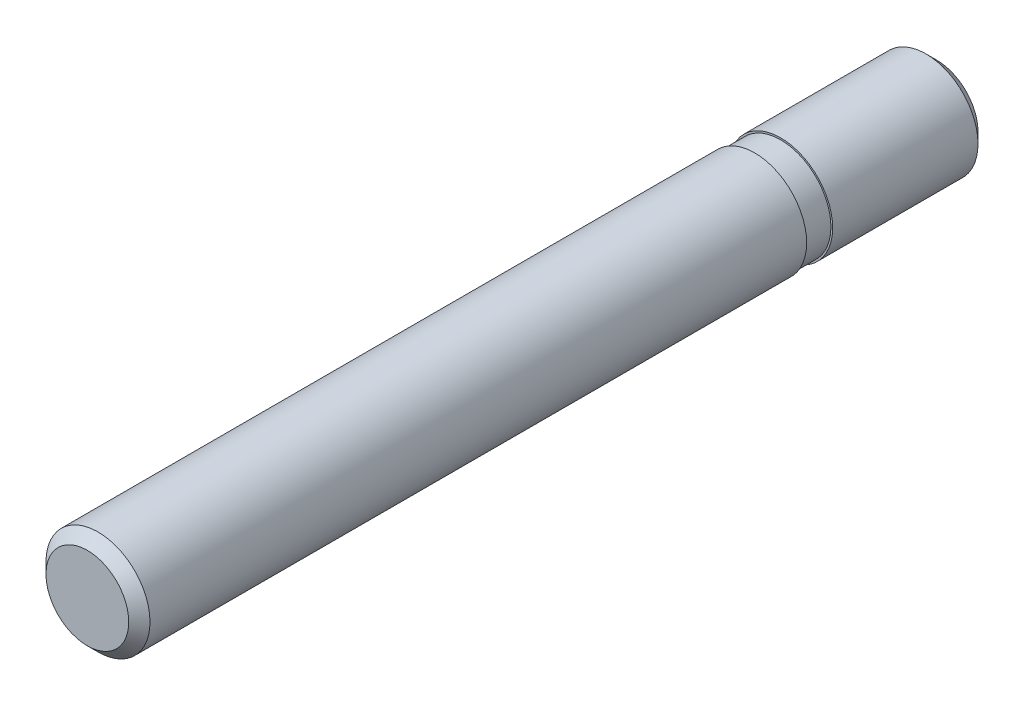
ISO-10303-21;
HEADER;
FILE_DESCRIPTION(('STEP AP214'),'2;1');
FILE_NAME('part.step','',(''),(''),'','','');
FILE_SCHEMA(('AUTOMOTIVE_DESIGN { 1 0 10303 214 1 1 1 1 }'));
ENDSEC;
DATA;
#1=APPLICATION_CONTEXT('core data for automotive mechanical design processes');
#2=APPLICATION_PROTOCOL_DEFINITION('international standard','automotive_design',2000,#1);
#3=PRODUCT_CONTEXT('',#1,'mechanical');
#4=PRODUCT('Part','Part','',(#3));
#5=PRODUCT_RELATED_PRODUCT_CATEGORY('part','',(#4));
#6=PRODUCT_DEFINITION_FORMATION('','',#4);
#7=PRODUCT_DEFINITION_CONTEXT('part definition',#1,'design');
#8=PRODUCT_DEFINITION('design','',#6,#7);
#9=PRODUCT_DEFINITION_SHAPE('','',#8);
#10=(LENGTH_UNIT() NAMED_UNIT(*) SI_UNIT(.MILLI.,.METRE.));
#11=(NAMED_UNIT(*) PLANE_ANGLE_UNIT() SI_UNIT($,.RADIAN.));
#12=(NAMED_UNIT(*) SI_UNIT($,.STERADIAN.) SOLID_ANGLE_UNIT());
#13=UNCERTAINTY_MEASURE_WITH_UNIT(LENGTH_MEASURE(1.E-05),#10,'distance_accuracy_value','');
#14=(GEOMETRIC_REPRESENTATION_CONTEXT(3) GLOBAL_UNCERTAINTY_ASSIGNED_CONTEXT((#13)) GLOBAL_UNIT_ASSIGNED_CONTEXT((#10,
#11,#12)) REPRESENTATION_CONTEXT('',''));
#15=CARTESIAN_POINT('',(0.,0.,0.));
#16=DIRECTION('',(0.,0.,1.));
#17=DIRECTION('',(1.,0.,0.));
#18=AXIS2_PLACEMENT_3D('',#15,#16,#17);
#19=CARTESIAN_POINT('',(0.,1.19325,-9.));
#20=DIRECTION('',(0.,0.,-1.));
#21=DIRECTION('',(-1.,0.,0.));
#22=AXIS2_PLACEMENT_3D('',#19,#20,#21);
#23=PLANE('',#22);
#24=CARTESIAN_POINT('',(0.,0.,-9.));
#25=DIRECTION('',(0.,0.,1.));
#26=DIRECTION('',(1.,0.,0.));
#27=AXIS2_PLACEMENT_3D('',#24,#25,#26);
#28=CIRCLE('',#27,2.38649999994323);
#29=CARTESIAN_POINT('',(2.38649999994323,0.,-9.));
#30=VERTEX_POINT('',#29);
#31=EDGE_CURVE('E19',#30,#30,#28,.T.);
#32=ORIENTED_EDGE('',*,*,#31,.F.);
#33=EDGE_LOOP('',(#32));
#34=FACE_BOUND('',#33,.T.);
#35=ADVANCED_FACE('F12',(#34),#23,.T.);
#36=CARTESIAN_POINT('',(0.,0.,-8.38649999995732));
#37=DIRECTION('',(0.,0.,1.));
#38=DIRECTION('',(1.,0.,0.));
#39=AXIS2_PLACEMENT_3D('',#36,#37,#38);
#40=CONICAL_SURFACE('',#39,2.99999999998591,0.785398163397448);
#41=CARTESIAN_POINT('',(0.,0.,-8.3865));
#42=DIRECTION('',(0.,0.,1.));
#43=DIRECTION('',(1.,0.,0.));
#44=AXIS2_PLACEMENT_3D('',#41,#42,#43);
#45=CIRCLE('',#44,3.);
#46=CARTESIAN_POINT('',(3.,0.,-8.3865));
#47=VERTEX_POINT('',#46);
#48=EDGE_CURVE('E23',#47,#47,#45,.T.);
#49=ORIENTED_EDGE('',*,*,#48,.F.);
#50=EDGE_LOOP('',(#49));
#51=FACE_BOUND('',#50,.T.);
#52=ORIENTED_EDGE('',*,*,#31,.T.);
#53=EDGE_LOOP('',(#52));
#54=FACE_BOUND('',#53,.T.);
#55=ADVANCED_FACE('F65',(#51,#54),#40,.T.);
#56=CARTESIAN_POINT('',(0.,0.,6.25));
#57=DIRECTION('',(0.,0.,1.));
#58=DIRECTION('',(1.,0.,0.));
#59=AXIS2_PLACEMENT_3D('',#56,#57,#58);
#60=CYLINDRICAL_SURFACE('',#59,3.);
#61=CARTESIAN_POINT('',(0.,0.,0.));
#62=DIRECTION('',(0.,0.,1.));
#63=DIRECTION('',(1.,0.,0.));
#64=AXIS2_PLACEMENT_3D('',#61,#62,#63);
#65=CIRCLE('',#64,3.);
#66=CARTESIAN_POINT('',(3.,0.,0.));
#67=VERTEX_POINT('',#66);
#68=EDGE_CURVE('E28',#67,#67,#65,.T.);
#69=ORIENTED_EDGE('',*,*,#68,.F.);
#70=EDGE_LOOP('',(#69));
#71=FACE_BOUND('',#70,.T.);
#72=ORIENTED_EDGE('',*,*,#48,.T.);
#73=EDGE_LOOP('',(#72));
#74=FACE_BOUND('',#73,.T.);
#75=ADVANCED_FACE('F70',(#71,#74),#60,.T.);
#76=CARTESIAN_POINT('',(0.,0.,0.));
#77=DIRECTION('',(0.,0.,1.));
#78=DIRECTION('',(1.,0.,0.));
#79=AXIS2_PLACEMENT_3D('',#76,#77,#78);
#80=PLANE('',#79);
#81=CARTESIAN_POINT('',(0.,0.,0.));
#82=DIRECTION('',(0.,0.,1.));
#83=DIRECTION('',(1.,0.,0.));
#84=AXIS2_PLACEMENT_3D('',#81,#82,#83);
#85=CIRCLE('',#84,2.9);
#86=CARTESIAN_POINT('',(2.9,0.,0.));
#87=VERTEX_POINT('',#86);
#88=EDGE_CURVE('E8',#87,#87,#85,.T.);
#89=ORIENTED_EDGE('',*,*,#88,.F.);
#90=EDGE_LOOP('',(#89));
#91=FACE_BOUND('',#90,.T.);
#92=ORIENTED_EDGE('',*,*,#68,.T.);
#93=EDGE_LOOP('',(#92));
#94=FACE_BOUND('',#93,.T.);
#95=ADVANCED_FACE('F75',(#91,#94),#80,.T.);
#96=CARTESIAN_POINT('',(0.,0.,-2.16481346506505));
#97=DIRECTION('',(0.,0.,-1.));
#98=DIRECTION('',(-1.,0.,0.));
#99=AXIS2_PLACEMENT_3D('',#96,#97,#98);
#100=CYLINDRICAL_SURFACE('',#99,2.9);
#101=CARTESIAN_POINT('',(0.,0.,1.5));
#102=DIRECTION('',(0.,0.,-1.));
#103=DIRECTION('',(-1.,0.,0.));
#104=AXIS2_PLACEMENT_3D('',#101,#102,#103);
#105=CIRCLE('',#104,2.9);
#106=CARTESIAN_POINT('',(-2.9,0.,1.5));
#107=VERTEX_POINT('',#106);
#108=EDGE_CURVE('E44',#107,#107,#105,.T.);
#109=ORIENTED_EDGE('',*,*,#108,.T.);
#110=EDGE_LOOP('',(#109));
#111=FACE_BOUND('',#110,.T.);
#112=ORIENTED_EDGE('',*,*,#88,.T.);
#113=EDGE_LOOP('',(#112));
#114=FACE_BOUND('',#113,.T.);
#115=ADVANCED_FACE('F51',(#111,#114),#100,.T.);
#116=CARTESIAN_POINT('',(0.,0.,40.));
#117=DIRECTION('',(0.,0.,1.));
#118=DIRECTION('',(1.,0.,0.));
#119=AXIS2_PLACEMENT_3D('',#116,#117,#118);
#120=PLANE('',#119);
#121=CARTESIAN_POINT('',(0.,0.,40.));
#122=DIRECTION('',(0.,0.,1.));
#123=DIRECTION('',(1.,0.,0.));
#124=AXIS2_PLACEMENT_3D('',#121,#122,#123);
#125=CIRCLE('',#124,2.3865);
#126=CARTESIAN_POINT('',(2.3865,0.,40.));
#127=VERTEX_POINT('',#126);
#128=EDGE_CURVE('E40',#127,#127,#125,.T.);
#129=ORIENTED_EDGE('',*,*,#128,.T.);
#130=EDGE_LOOP('',(#129));
#131=FACE_BOUND('',#130,.T.);
#132=ADVANCED_FACE('F82',(#131),#120,.T.);
#133=CARTESIAN_POINT('',(0.,0.,40.));
#134=DIRECTION('',(0.,0.,-1.));
#135=DIRECTION('',(-1.,0.,0.));
#136=AXIS2_PLACEMENT_3D('',#133,#134,#135);
#137=CONICAL_SURFACE('',#136,2.3865,0.785398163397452);
#138=CARTESIAN_POINT('',(0.,0.,39.3865));
#139=DIRECTION('',(0.,0.,1.));
#140=DIRECTION('',(1.,0.,0.));
#141=AXIS2_PLACEMENT_3D('',#138,#139,#140);
#142=CIRCLE('',#141,3.);
#143=CARTESIAN_POINT('',(3.,0.,39.3865));
#144=VERTEX_POINT('',#143);
#145=EDGE_CURVE('E31',#144,#144,#142,.F.);
#146=ORIENTED_EDGE('',*,*,#145,.F.);
#147=EDGE_LOOP('',(#146));
#148=FACE_BOUND('',#147,.T.);
#149=ORIENTED_EDGE('',*,*,#128,.F.);
#150=EDGE_LOOP('',(#149));
#151=FACE_BOUND('',#150,.T.);
#152=ADVANCED_FACE('F61',(#148,#151),#137,.T.);
#153=CARTESIAN_POINT('',(0.,0.,6.25));
#154=DIRECTION('',(0.,0.,1.));
#155=DIRECTION('',(1.,0.,0.));
#156=AXIS2_PLACEMENT_3D('',#153,#154,#155);
#157=CYLINDRICAL_SURFACE('',#156,3.);
#158=CARTESIAN_POINT('',(0.,0.,1.5));
#159=DIRECTION('',(0.,0.,1.));
#160=DIRECTION('',(1.,0.,0.));
#161=AXIS2_PLACEMENT_3D('',#158,#159,#160);
#162=CIRCLE('',#161,3.);
#163=CARTESIAN_POINT('',(3.,0.,1.5));
#164=VERTEX_POINT('',#163);
#165=EDGE_CURVE('E35',#164,#164,#162,.T.);
#166=ORIENTED_EDGE('',*,*,#165,.T.);
#167=EDGE_LOOP('',(#166));
#168=FACE_BOUND('',#167,.T.);
#169=ORIENTED_EDGE('',*,*,#145,.T.);
#170=EDGE_LOOP('',(#169));
#171=FACE_BOUND('',#170,.T.);
#172=ADVANCED_FACE('F14',(#168,#171),#157,.T.);
#173=CARTESIAN_POINT('',(0.,0.,1.5));
#174=DIRECTION('',(0.,0.,1.));
#175=DIRECTION('',(1.,0.,0.));
#176=AXIS2_PLACEMENT_3D('',#173,#174,#175);
#177=PLANE('',#176);
#178=ORIENTED_EDGE('',*,*,#108,.F.);
#179=EDGE_LOOP('',(#178));
#180=FACE_BOUND('',#179,.T.);
#181=ORIENTED_EDGE('',*,*,#165,.F.);
#182=EDGE_LOOP('',(#181));
#183=FACE_BOUND('',#182,.T.);
#184=ADVANCED_FACE('F53',(#180,#183),#177,.F.);
#185=CLOSED_SHELL('',(#35,#55,#75,#95,#115,#132,#152,#172,#184));
#186=MANIFOLD_SOLID_BREP('B1',#185);
#187=ADVANCED_BREP_SHAPE_REPRESENTATION('',(#18,#186),#14);
#188=SHAPE_DEFINITION_REPRESENTATION(#9,#187);
ENDSEC;
END-ISO-10303-21;
